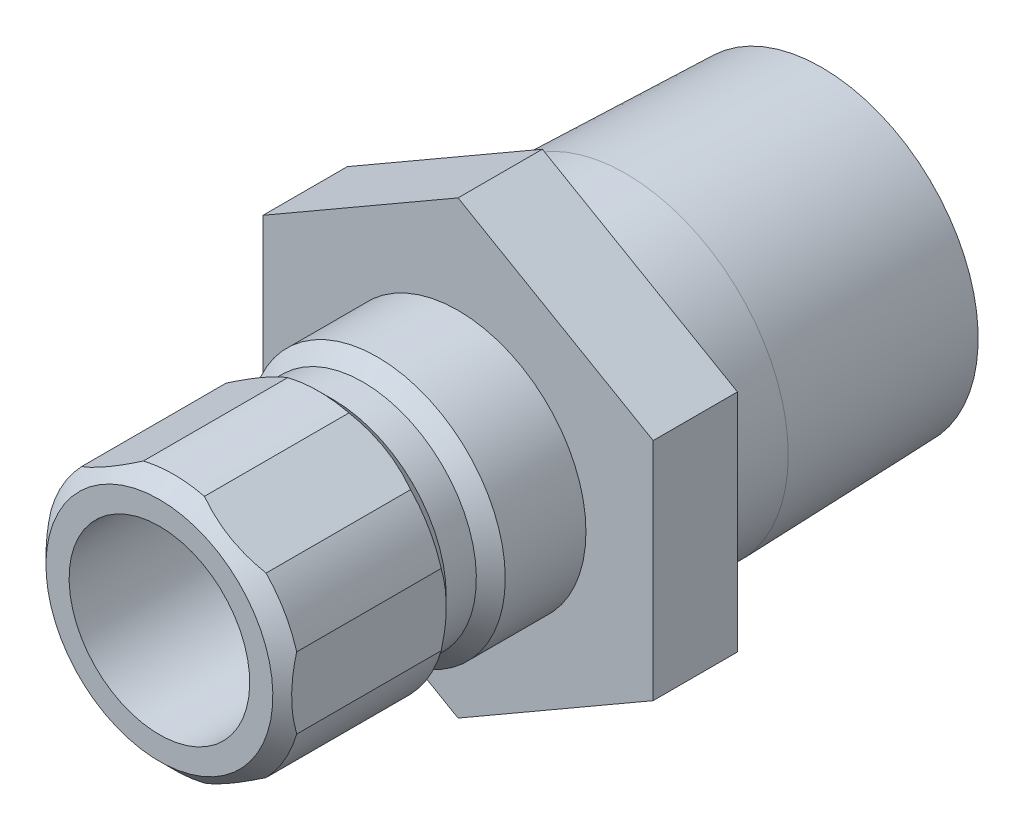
from build123d import *

# Parameters (mm, degrees)
SKETCH2_R           = 4.7625
BOSS_EXTRUDE1_DEPTH = 4.445
CUT_EXTRUDE1_START  = 6.604
SKETCH3_OUTSIDE_W   = 31.97
SKETCH3_OUTSIDE_H   = 35.152
CUT_EXTRUDE1_DEPTH  = 19.188664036


with BuildPart() as part:
    # Sketch1 → Revolve1 (revolve)
    with BuildSketch(Plane(origin=(0, 0, 0), x_dir=(0, 0, -1), z_dir=(1, 0, 0))):
        Polygon((-15.748, 4.7625), (-15.748, 5.9817), (-14.986, 6.7437), (-7.366, 6.7437), (-6.604, 5.9817), (-5.0165, 5.9817), (-4.2545, 6.7437), (0, 6.7437), (0, 8.5725), (8.8392, 8.5725), (19.177, 8.249445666), (19.177, 6.2611), (0.923819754, 6.2611), (0.127, 4.7625), align=None)
    revolve(axis=Axis((0, 0, 0), (0, 0, 1)))

    # Sketch2 → Boss-Extrude1 (add)
    with BuildSketch(Plane.XY):
        Polygon((-10.287, 5.939202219), (-10.287, -5.939202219), (0, -11.878404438), (10.287, -5.939202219), (10.287, 5.939202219), (0, 11.878404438), align=None)
        with Locations(Location((0, 0, 0), (0, 0, 90))):
            Circle(SKETCH2_R, mode=Mode.SUBTRACT)
    extrude(amount=-BOSS_EXTRUDE1_DEPTH)

    # Sketch3 outside → Cut-Extrude1 (cut, through all)
    with BuildSketch(Plane.XY.offset(CUT_EXTRUDE1_START)):
        Rectangle(SKETCH3_OUTSIDE_W, SKETCH3_OUTSIDE_H)
        Polygon((-6.477, 3.739497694), (-6.477, -3.739497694), (0, -7.478995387), (6.477, -3.739497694), (6.477, 3.739497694), (0, 7.478995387), align=None, mode=Mode.SUBTRACT)
    extrude(amount=CUT_EXTRUDE1_DEPTH, mode=Mode.SUBTRACT)


solid = part.part
